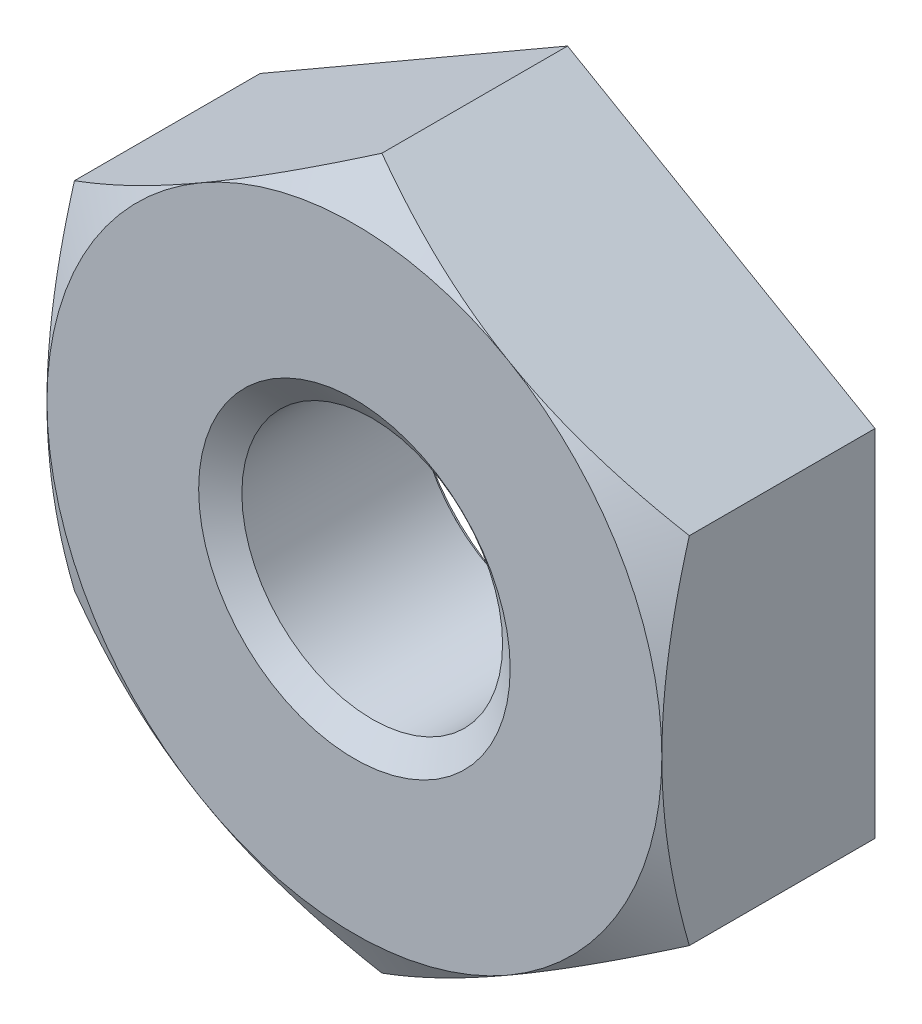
from build123d import *

# Parameters (mm, degrees)
BASENUT_START = -3.302
BASENUTSKE_R  = 2.0193
BASENUT_DEPTH = 3.302


with BuildPart() as part:
    # BaseNutSke → BaseNut (new body)
    with BuildSketch(Plane.XY.offset(BASENUT_START)):
        Polygon((4.7625, 2.749630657), (4.7625, -2.749630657), (0, -5.499261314), (-4.7625, -2.749630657), (-4.7625, 2.749630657), (0, 5.499261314), align=None)
        Circle(BASENUTSKE_R, mode=Mode.SUBTRACT)
    extrude(amount=BASENUT_DEPTH)

    # Sketch4 → Single-Chamfer (revolve, cut)
    with BuildSketch(Plane(origin=(0, 0, 0), x_dir=(0, 0, -1), z_dir=(1, 0, 0))):
        Polygon((0, 4.7625), (-12.7, 4.7625), (-12.7, 18.199261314), (0.425369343, 18.199261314), (0.425369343, 5.499261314), align=None)
    revolve(axis=Axis((0, 0, 0), (0, 0, -1)), mode=Mode.SUBTRACT)

    # EndChamferSketch → EndChamfer (revolve, cut)
    with BuildSketch(Plane(origin=(0, 0, 0), x_dir=(0, 0, -1), z_dir=(1, 0, 0)), mode=Mode.PRIVATE) as endchamfer_sk:
        Polygon((3.2766, 2.413), (2.973361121, 1.97993), (3.3274, 1.97993), (3.3274, 2.413), align=None)
        Polygon((-0.0508, 2.413), (0, 2.413), (0.303238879, 1.97993), (-0.0508, 1.97993), align=None)
    revolve(endchamfer_sk.sketch.rotate(Axis((0, 0, -25.037505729), (0, 0, -1)), 90), axis=Axis((0, 0, -25.037505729), (0, 0, -1)), mode=Mode.SUBTRACT)


solid = part.part
